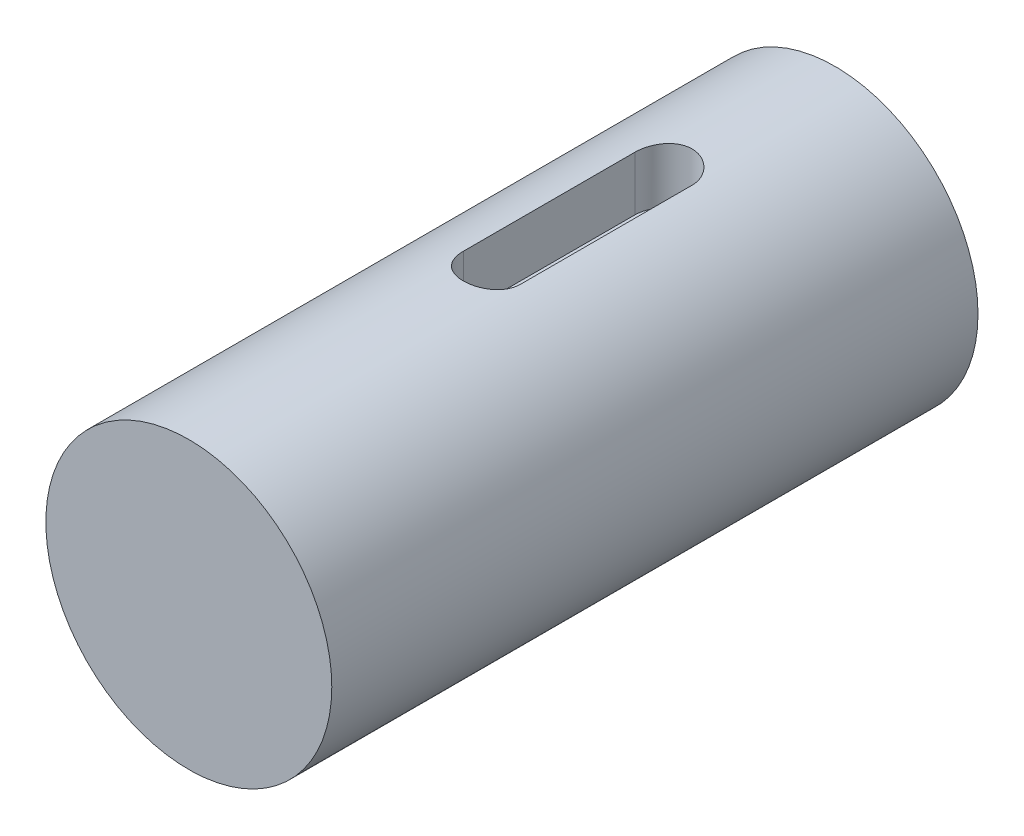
ISO-10303-21;
HEADER;
FILE_DESCRIPTION(('STEP AP214'),'2;1');
FILE_NAME('part.step','',(''),(''),'','','');
FILE_SCHEMA(('AUTOMOTIVE_DESIGN { 1 0 10303 214 1 1 1 1 }'));
ENDSEC;
DATA;
#1=APPLICATION_CONTEXT('core data for automotive mechanical design processes');
#2=APPLICATION_PROTOCOL_DEFINITION('international standard','automotive_design',2000,#1);
#3=PRODUCT_CONTEXT('',#1,'mechanical');
#4=PRODUCT('Part','Part','',(#3));
#5=PRODUCT_RELATED_PRODUCT_CATEGORY('part','',(#4));
#6=PRODUCT_DEFINITION_FORMATION('','',#4);
#7=PRODUCT_DEFINITION_CONTEXT('part definition',#1,'design');
#8=PRODUCT_DEFINITION('design','',#6,#7);
#9=PRODUCT_DEFINITION_SHAPE('','',#8);
#10=(LENGTH_UNIT() NAMED_UNIT(*) SI_UNIT(.MILLI.,.METRE.));
#11=(NAMED_UNIT(*) PLANE_ANGLE_UNIT() SI_UNIT($,.RADIAN.));
#12=(NAMED_UNIT(*) SI_UNIT($,.STERADIAN.) SOLID_ANGLE_UNIT());
#13=UNCERTAINTY_MEASURE_WITH_UNIT(LENGTH_MEASURE(1.E-05),#10,'distance_accuracy_value','');
#14=(GEOMETRIC_REPRESENTATION_CONTEXT(3) GLOBAL_UNCERTAINTY_ASSIGNED_CONTEXT((#13)) GLOBAL_UNIT_ASSIGNED_CONTEXT((#10,
#11,#12)) REPRESENTATION_CONTEXT('',''));
#15=CARTESIAN_POINT('',(0.,0.,0.));
#16=DIRECTION('',(0.,0.,1.));
#17=DIRECTION('',(1.,0.,0.));
#18=AXIS2_PLACEMENT_3D('',#15,#16,#17);
#19=CARTESIAN_POINT('',(0.,0.,56.5));
#20=DIRECTION('',(0.,0.,-1.));
#21=DIRECTION('',(-1.,0.,0.));
#22=AXIS2_PLACEMENT_3D('',#19,#20,#21);
#23=CYLINDRICAL_SURFACE('',#22,12.5);
#24=DIRECTION('',(0.,0.,-1.));
#25=VECTOR('',#24,1.);
#26=CARTESIAN_POINT('',(-2.5,12.2474487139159,56.5));
#27=LINE('',#26,#25);
#28=CARTESIAN_POINT('',(-2.5,12.2474487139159,30.));
#29=VERTEX_POINT('',#28);
#30=CARTESIAN_POINT('',(-2.5,12.2474487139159,15.));
#31=VERTEX_POINT('',#30);
#32=EDGE_CURVE('E11',#29,#31,#27,.T.);
#33=ORIENTED_EDGE('',*,*,#32,.T.);
#34=CARTESIAN_POINT('',(-2.5,12.2474487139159,15.));
#35=CARTESIAN_POINT('',(-2.50000755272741,12.2474426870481,14.9304359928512));
#36=CARTESIAN_POINT('',(-2.49709659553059,12.2480412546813,14.8608761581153));
#37=CARTESIAN_POINT('',(-2.48549624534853,12.2504029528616,14.7222682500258));
#38=CARTESIAN_POINT('',(-2.47680756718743,12.2521659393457,14.6532201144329));
#39=CARTESIAN_POINT('',(-2.45372788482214,12.25680833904,14.5162257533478));
#40=CARTESIAN_POINT('',(-2.43934556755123,12.259686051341,14.4482780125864));
#41=CARTESIAN_POINT('',(-2.40500601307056,12.2664685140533,14.3138779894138));
#42=CARTESIAN_POINT('',(-2.38504875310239,12.2703732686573,14.2474257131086));
#43=CARTESIAN_POINT('',(-2.31701273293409,12.2834692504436,14.0509952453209));
#44=CARTESIAN_POINT('',(-2.26075131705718,12.2940461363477,13.9238349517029));
#45=CARTESIAN_POINT('',(-2.12812970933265,12.3176934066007,13.6808105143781));
#46=CARTESIAN_POINT('',(-2.0517674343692,12.3307640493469,13.5649475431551));
#47=CARTESIAN_POINT('',(-1.87995278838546,12.3581317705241,13.3461078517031));
#48=CARTESIAN_POINT('',(-1.78427266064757,12.3724421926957,13.2433112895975));
#49=CARTESIAN_POINT('',(-1.57702607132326,12.4005606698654,13.0551119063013));
#50=CARTESIAN_POINT('',(-1.46545715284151,12.4143686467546,12.9697117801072));
#51=CARTESIAN_POINT('',(-1.2284002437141,12.4400702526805,12.8180282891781));
#52=CARTESIAN_POINT('',(-1.10279959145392,12.4519461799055,12.751917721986));
#53=CARTESIAN_POINT('',(-0.842002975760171,12.4722938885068,12.6418101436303));
#54=CARTESIAN_POINT('',(-0.706808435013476,12.4807661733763,12.5978098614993));
#55=CARTESIAN_POINT('',(-0.432543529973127,12.4932579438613,12.5337324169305));
#56=CARTESIAN_POINT('',(-0.293547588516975,12.4973345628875,12.5133480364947));
#57=CARTESIAN_POINT('',(-0.0140496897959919,12.5007730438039,12.4961225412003));
#58=CARTESIAN_POINT('',(0.126452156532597,12.5001352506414,12.499279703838));
#59=CARTESIAN_POINT('',(0.402855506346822,12.494260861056,12.5288155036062));
#60=CARTESIAN_POINT('',(0.538794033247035,12.4890899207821,12.5548626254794));
#61=CARTESIAN_POINT('',(0.804330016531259,12.4748043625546,12.6289129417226));
#62=CARTESIAN_POINT('',(0.933927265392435,12.4656896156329,12.6769168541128));
#63=CARTESIAN_POINT('',(1.1840506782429,12.4444322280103,12.7938260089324));
#64=CARTESIAN_POINT('',(1.30451431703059,12.4322708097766,12.8628614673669));
#65=CARTESIAN_POINT('',(1.53226609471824,12.4062612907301,13.0197756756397));
#66=CARTESIAN_POINT('',(1.63955314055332,12.3924130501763,13.1076559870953));
#67=CARTESIAN_POINT('',(1.83986551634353,12.3642759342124,13.3015709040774));
#68=CARTESIAN_POINT('',(1.93261173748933,12.3499835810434,13.4078935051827));
#69=CARTESIAN_POINT('',(2.0990272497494,12.3227926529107,13.6347618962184));
#70=CARTESIAN_POINT('',(2.17269125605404,12.3098944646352,13.7553116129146));
#71=CARTESIAN_POINT('',(2.29894988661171,12.286943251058,14.0076310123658));
#72=CARTESIAN_POINT('',(2.3514871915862,12.2768979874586,14.1394300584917));
#73=CARTESIAN_POINT('',(2.43351774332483,12.2609040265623,14.410146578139));
#74=CARTESIAN_POINT('',(2.46304531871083,12.2549492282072,14.5490531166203));
#75=CARTESIAN_POINT('',(2.48708234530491,12.2500794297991,14.7408920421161));
#76=CARTESIAN_POINT('',(2.49192813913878,12.2490939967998,14.7926353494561));
#77=CARTESIAN_POINT('',(2.49838291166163,12.2477791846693,14.8962446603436));
#78=CARTESIAN_POINT('',(2.49999730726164,12.2474487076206,14.9481103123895));
#79=CARTESIAN_POINT('',(2.5,12.2474487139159,15.));
#80=B_SPLINE_CURVE_WITH_KNOTS('',3,(#34,#35,#36,#37,#38,#39,#40,#41,#42,#43,#44,#45,#46,#47,#48,
#49,#50,#51,#52,#53,#54,#55,#56,#57,#58,#59,#60,#61,#62,#63,#64,#65,#66,#67,#68,#69,#70,#71,#72,
#73,#74,#75,#76,#77,#78,#79),.UNSPECIFIED.,.F.,.F.,(4,2,2,2,2,2,2,2,2,2,2,2,2,2,2,2,2,2,2,2,2,2,
4),(0.,0.208621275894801,0.417216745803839,0.625495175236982,0.833774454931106,1.25000691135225,
1.66628252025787,2.08778731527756,2.50935735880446,2.93459542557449,3.35977056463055,
3.77935021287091,4.19889916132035,4.61247011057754,5.02605458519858,5.44225366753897,
5.85848725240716,6.28192795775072,6.70548580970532,7.13018519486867,7.55424974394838,
7.71010621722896,7.86570120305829),.UNSPECIFIED.);
#81=CARTESIAN_POINT('',(2.5,12.2474487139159,15.));
#82=VERTEX_POINT('',#81);
#83=EDGE_CURVE('E106',#31,#82,#80,.T.);
#84=ORIENTED_EDGE('',*,*,#83,.T.);
#85=DIRECTION('',(0.,0.,-1.));
#86=VECTOR('',#85,1.);
#87=CARTESIAN_POINT('',(2.5,12.2474487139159,56.5));
#88=LINE('',#87,#86);
#89=CARTESIAN_POINT('',(2.5,12.2474487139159,30.));
#90=VERTEX_POINT('',#89);
#91=EDGE_CURVE('E41',#82,#90,#88,.F.);
#92=ORIENTED_EDGE('',*,*,#91,.T.);
#93=CARTESIAN_POINT('',(2.5,12.2474487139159,30.));
#94=CARTESIAN_POINT('',(2.50000755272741,12.2474426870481,30.0695640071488));
#95=CARTESIAN_POINT('',(2.4970965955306,12.2480412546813,30.1391238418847));
#96=CARTESIAN_POINT('',(2.48549624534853,12.2504029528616,30.2777317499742));
#97=CARTESIAN_POINT('',(2.47680756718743,12.2521659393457,30.3467798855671));
#98=CARTESIAN_POINT('',(2.45372788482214,12.25680833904,30.4837742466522));
#99=CARTESIAN_POINT('',(2.43934556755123,12.259686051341,30.5517219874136));
#100=CARTESIAN_POINT('',(2.40500601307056,12.2664685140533,30.6861220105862));
#101=CARTESIAN_POINT('',(2.38504875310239,12.2703732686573,30.7525742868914));
#102=CARTESIAN_POINT('',(2.31701273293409,12.2834692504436,30.9490047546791));
#103=CARTESIAN_POINT('',(2.26075131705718,12.2940461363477,31.0761650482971));
#104=CARTESIAN_POINT('',(2.12812970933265,12.3176934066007,31.3191894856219));
#105=CARTESIAN_POINT('',(2.0517674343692,12.3307640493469,31.4350524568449));
#106=CARTESIAN_POINT('',(1.87995278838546,12.3581317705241,31.6538921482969));
#107=CARTESIAN_POINT('',(1.78427266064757,12.3724421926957,31.7566887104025));
#108=CARTESIAN_POINT('',(1.57702607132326,12.4005606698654,31.9448880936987));
#109=CARTESIAN_POINT('',(1.46545715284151,12.4143686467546,32.0302882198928));
#110=CARTESIAN_POINT('',(1.2284002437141,12.4400702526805,32.1819717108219));
#111=CARTESIAN_POINT('',(1.10279959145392,12.4519461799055,32.248082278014));
#112=CARTESIAN_POINT('',(0.842002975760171,12.4722938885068,32.3581898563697));
#113=CARTESIAN_POINT('',(0.706808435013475,12.4807661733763,32.4021901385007));
#114=CARTESIAN_POINT('',(0.432543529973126,12.4932579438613,32.4662675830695));
#115=CARTESIAN_POINT('',(0.293547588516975,12.4973345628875,32.4866519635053));
#116=CARTESIAN_POINT('',(0.0140496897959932,12.5007730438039,32.5038774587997));
#117=CARTESIAN_POINT('',(-0.126452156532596,12.5001352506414,32.500720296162));
#118=CARTESIAN_POINT('',(-0.40285550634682,12.494260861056,32.4711844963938));
#119=CARTESIAN_POINT('',(-0.538794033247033,12.4890899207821,32.4451373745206));
#120=CARTESIAN_POINT('',(-0.804330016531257,12.4748043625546,32.3710870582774));
#121=CARTESIAN_POINT('',(-0.933927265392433,12.4656896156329,32.3230831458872));
#122=CARTESIAN_POINT('',(-1.1840506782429,12.4444322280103,32.2061739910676));
#123=CARTESIAN_POINT('',(-1.30451431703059,12.4322708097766,32.1371385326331));
#124=CARTESIAN_POINT('',(-1.53226609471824,12.4062612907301,31.9802243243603));
#125=CARTESIAN_POINT('',(-1.63955314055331,12.3924130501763,31.8923440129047));
#126=CARTESIAN_POINT('',(-1.83986551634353,12.3642759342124,31.6984290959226));
#127=CARTESIAN_POINT('',(-1.93261173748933,12.3499835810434,31.5921064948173));
#128=CARTESIAN_POINT('',(-2.0990272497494,12.3227926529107,31.3652381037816));
#129=CARTESIAN_POINT('',(-2.17269125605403,12.3098944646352,31.2446883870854));
#130=CARTESIAN_POINT('',(-2.29894988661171,12.286943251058,30.9923689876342));
#131=CARTESIAN_POINT('',(-2.3514871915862,12.2768979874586,30.8605699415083));
#132=CARTESIAN_POINT('',(-2.43351774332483,12.2609040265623,30.5898534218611));
#133=CARTESIAN_POINT('',(-2.46304531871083,12.2549492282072,30.4509468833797));
#134=CARTESIAN_POINT('',(-2.48708234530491,12.2500794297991,30.2591079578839));
#135=CARTESIAN_POINT('',(-2.49192813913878,12.2490939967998,30.2073646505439));
#136=CARTESIAN_POINT('',(-2.49838291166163,12.2477791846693,30.1037553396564));
#137=CARTESIAN_POINT('',(-2.49999730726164,12.2474487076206,30.0518896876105));
#138=CARTESIAN_POINT('',(-2.5,12.2474487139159,30.));
#139=B_SPLINE_CURVE_WITH_KNOTS('',3,(#93,#94,#95,#96,#97,#98,#99,#100,#101,#102,#103,#104,#105,
#106,#107,#108,#109,#110,#111,#112,#113,#114,#115,#116,#117,#118,#119,#120,#121,#122,#123,#124,
#125,#126,#127,#128,#129,#130,#131,#132,#133,#134,#135,#136,#137,#138),.UNSPECIFIED.,.F.,.F.,(4,
2,2,2,2,2,2,2,2,2,2,2,2,2,2,2,2,2,2,2,2,2,4),(0.,0.208621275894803,0.417216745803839,
0.625495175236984,0.833774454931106,1.25000691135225,1.66628252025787,2.08778731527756,
2.50935735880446,2.93459542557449,3.35977056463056,3.77935021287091,4.19889916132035,
4.61247011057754,5.02605458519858,5.44225366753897,5.85848725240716,6.28192795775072,
6.70548580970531,7.13018519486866,7.55424974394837,7.71010621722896,7.86570120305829),.UNSPECIFIED.);
#140=EDGE_CURVE('E48',#90,#29,#139,.T.);
#141=ORIENTED_EDGE('',*,*,#140,.T.);
#142=EDGE_LOOP('',(#33,#84,#92,#141));
#143=FACE_BOUND('',#142,.T.);
#144=CARTESIAN_POINT('',(0.,0.,56.5));
#145=DIRECTION('',(0.,0.,1.));
#146=DIRECTION('',(1.,0.,0.));
#147=AXIS2_PLACEMENT_3D('',#144,#145,#146);
#148=CIRCLE('',#147,12.5);
#149=CARTESIAN_POINT('',(12.5,0.,56.5));
#150=VERTEX_POINT('',#149);
#151=EDGE_CURVE('E103',#150,#150,#148,.T.);
#152=ORIENTED_EDGE('',*,*,#151,.F.);
#153=EDGE_LOOP('',(#152));
#154=FACE_BOUND('',#153,.T.);
#155=CARTESIAN_POINT('',(0.,0.,0.));
#156=DIRECTION('',(0.,0.,1.));
#157=DIRECTION('',(1.,0.,0.));
#158=AXIS2_PLACEMENT_3D('',#155,#156,#157);
#159=CIRCLE('',#158,12.5);
#160=CARTESIAN_POINT('',(12.5,0.,0.));
#161=VERTEX_POINT('',#160);
#162=EDGE_CURVE('E99',#161,#161,#159,.T.);
#163=ORIENTED_EDGE('',*,*,#162,.T.);
#164=EDGE_LOOP('',(#163));
#165=FACE_BOUND('',#164,.T.);
#166=ADVANCED_FACE('F33',(#143,#154,#165),#23,.T.);
#167=CARTESIAN_POINT('',(0.,0.,56.5));
#168=DIRECTION('',(0.,0.,1.));
#169=DIRECTION('',(1.,0.,0.));
#170=AXIS2_PLACEMENT_3D('',#167,#168,#169);
#171=PLANE('',#170);
#172=ORIENTED_EDGE('',*,*,#151,.T.);
#173=EDGE_LOOP('',(#172));
#174=FACE_BOUND('',#173,.T.);
#175=ADVANCED_FACE('F132',(#174),#171,.T.);
#176=CARTESIAN_POINT('',(0.,0.,0.));
#177=DIRECTION('',(0.,0.,1.));
#178=DIRECTION('',(1.,0.,0.));
#179=AXIS2_PLACEMENT_3D('',#176,#177,#178);
#180=PLANE('',#179);
#181=ORIENTED_EDGE('',*,*,#162,.F.);
#182=EDGE_LOOP('',(#181));
#183=FACE_BOUND('',#182,.T.);
#184=ADVANCED_FACE('F131',(#183),#180,.F.);
#185=CARTESIAN_POINT('',(0.,7.5,30.));
#186=DIRECTION('',(0.,1.,0.));
#187=DIRECTION('',(0.,0.,1.));
#188=AXIS2_PLACEMENT_3D('',#185,#186,#187);
#189=CYLINDRICAL_SURFACE('',#188,2.5);
#190=DIRECTION('',(0.,1.,0.));
#191=VECTOR('',#190,1.);
#192=CARTESIAN_POINT('',(2.5,7.5,30.));
#193=LINE('',#192,#191);
#194=CARTESIAN_POINT('',(2.5,7.5,30.));
#195=VERTEX_POINT('',#194);
#196=EDGE_CURVE('E71',#195,#90,#193,.T.);
#197=ORIENTED_EDGE('',*,*,#196,.F.);
#198=CARTESIAN_POINT('',(0.,7.5,30.));
#199=DIRECTION('',(0.,1.,0.));
#200=DIRECTION('',(0.,0.,-1.));
#201=AXIS2_PLACEMENT_3D('',#198,#199,#200);
#202=CIRCLE('',#201,2.5);
#203=CARTESIAN_POINT('',(-2.5,7.5,30.));
#204=VERTEX_POINT('',#203);
#205=EDGE_CURVE('E75',#204,#195,#202,.T.);
#206=ORIENTED_EDGE('',*,*,#205,.F.);
#207=DIRECTION('',(0.,1.,0.));
#208=VECTOR('',#207,1.);
#209=CARTESIAN_POINT('',(-2.5,7.5,30.));
#210=LINE('',#209,#208);
#211=EDGE_CURVE('E97',#204,#29,#210,.T.);
#212=ORIENTED_EDGE('',*,*,#211,.T.);
#213=ORIENTED_EDGE('',*,*,#140,.F.);
#214=EDGE_LOOP('',(#197,#206,#212,#213));
#215=FACE_BOUND('',#214,.T.);
#216=ADVANCED_FACE('F73',(#215),#189,.F.);
#217=CARTESIAN_POINT('',(-2.5,7.5,30.));
#218=DIRECTION('',(-1.,0.,0.));
#219=DIRECTION('',(0.,0.,1.));
#220=AXIS2_PLACEMENT_3D('',#217,#218,#219);
#221=PLANE('',#220);
#222=ORIENTED_EDGE('',*,*,#211,.F.);
#223=DIRECTION('',(0.,0.,1.));
#224=VECTOR('',#223,1.);
#225=CARTESIAN_POINT('',(-2.5,7.5,30.));
#226=LINE('',#225,#224);
#227=CARTESIAN_POINT('',(-2.5,7.5,15.));
#228=VERTEX_POINT('',#227);
#229=EDGE_CURVE('E80',#228,#204,#226,.T.);
#230=ORIENTED_EDGE('',*,*,#229,.F.);
#231=DIRECTION('',(0.,1.,0.));
#232=VECTOR('',#231,1.);
#233=CARTESIAN_POINT('',(-2.5,7.5,15.));
#234=LINE('',#233,#232);
#235=EDGE_CURVE('E100',#228,#31,#234,.T.);
#236=ORIENTED_EDGE('',*,*,#235,.T.);
#237=ORIENTED_EDGE('',*,*,#32,.F.);
#238=EDGE_LOOP('',(#222,#230,#236,#237));
#239=FACE_BOUND('',#238,.T.);
#240=ADVANCED_FACE('F124',(#239),#221,.F.);
#241=CARTESIAN_POINT('',(0.,7.5,15.));
#242=DIRECTION('',(0.,1.,0.));
#243=DIRECTION('',(0.,0.,1.));
#244=AXIS2_PLACEMENT_3D('',#241,#242,#243);
#245=CYLINDRICAL_SURFACE('',#244,2.5);
#246=ORIENTED_EDGE('',*,*,#235,.F.);
#247=CARTESIAN_POINT('',(0.,7.5,15.));
#248=DIRECTION('',(0.,1.,0.));
#249=DIRECTION('',(0.,0.,-1.));
#250=AXIS2_PLACEMENT_3D('',#247,#248,#249);
#251=CIRCLE('',#250,2.5);
#252=CARTESIAN_POINT('',(2.5,7.5,15.));
#253=VERTEX_POINT('',#252);
#254=EDGE_CURVE('E89',#253,#228,#251,.T.);
#255=ORIENTED_EDGE('',*,*,#254,.F.);
#256=DIRECTION('',(0.,1.,0.));
#257=VECTOR('',#256,1.);
#258=CARTESIAN_POINT('',(2.5,7.5,15.));
#259=LINE('',#258,#257);
#260=EDGE_CURVE('E79',#253,#82,#259,.T.);
#261=ORIENTED_EDGE('',*,*,#260,.T.);
#262=ORIENTED_EDGE('',*,*,#83,.F.);
#263=EDGE_LOOP('',(#246,#255,#261,#262));
#264=FACE_BOUND('',#263,.T.);
#265=ADVANCED_FACE('F119',(#264),#245,.F.);
#266=CARTESIAN_POINT('',(2.5,7.5,15.));
#267=DIRECTION('',(1.,0.,0.));
#268=DIRECTION('',(0.,0.,-1.));
#269=AXIS2_PLACEMENT_3D('',#266,#267,#268);
#270=PLANE('',#269);
#271=ORIENTED_EDGE('',*,*,#260,.F.);
#272=DIRECTION('',(0.,0.,-1.));
#273=VECTOR('',#272,1.);
#274=CARTESIAN_POINT('',(2.5,7.5,15.));
#275=LINE('',#274,#273);
#276=EDGE_CURVE('E83',#195,#253,#275,.T.);
#277=ORIENTED_EDGE('',*,*,#276,.F.);
#278=ORIENTED_EDGE('',*,*,#196,.T.);
#279=ORIENTED_EDGE('',*,*,#91,.F.);
#280=EDGE_LOOP('',(#271,#277,#278,#279));
#281=FACE_BOUND('',#280,.T.);
#282=ADVANCED_FACE('F84',(#281),#270,.F.);
#283=CARTESIAN_POINT('',(0.,7.5,30.));
#284=DIRECTION('',(0.,-1.,0.));
#285=DIRECTION('',(0.,0.,-1.));
#286=AXIS2_PLACEMENT_3D('',#283,#284,#285);
#287=PLANE('',#286);
#288=ORIENTED_EDGE('',*,*,#205,.T.);
#289=ORIENTED_EDGE('',*,*,#276,.T.);
#290=ORIENTED_EDGE('',*,*,#254,.T.);
#291=ORIENTED_EDGE('',*,*,#229,.T.);
#292=EDGE_LOOP('',(#288,#289,#290,#291));
#293=FACE_BOUND('',#292,.T.);
#294=ADVANCED_FACE('F91',(#293),#287,.F.);
#295=CLOSED_SHELL('',(#166,#175,#184,#216,#240,#265,#282,#294));
#296=MANIFOLD_SOLID_BREP('B2',#295);
#297=ADVANCED_BREP_SHAPE_REPRESENTATION('',(#18,#296),#14);
#298=SHAPE_DEFINITION_REPRESENTATION(#9,#297);
ENDSEC;
END-ISO-10303-21;
